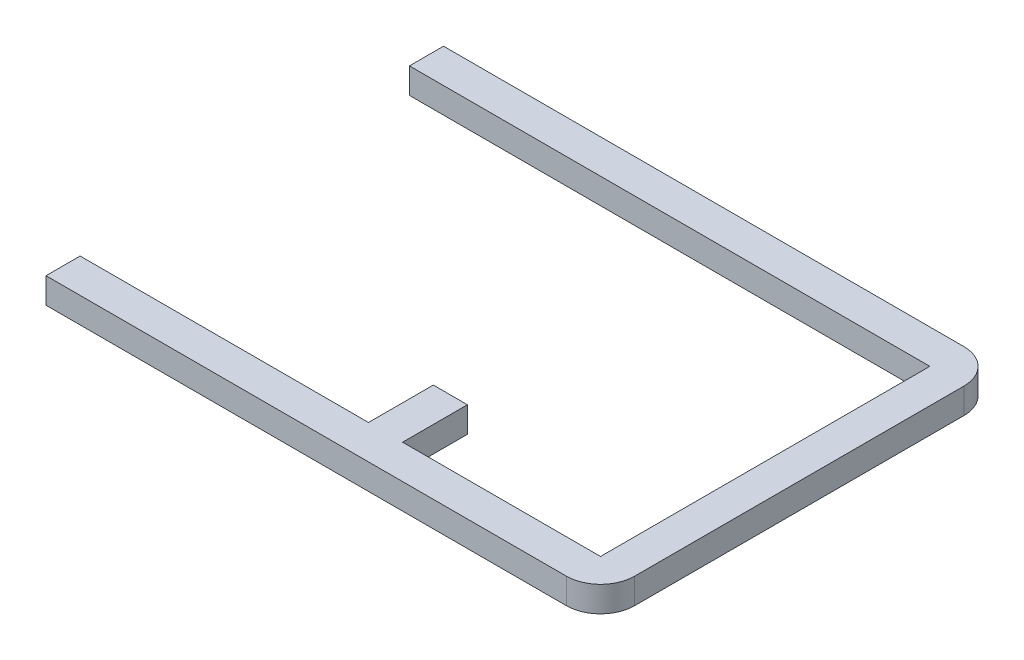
ISO-10303-21;
HEADER;
FILE_DESCRIPTION(('STEP AP214'),'2;1');
FILE_NAME('part.step','',(''),(''),'','','');
FILE_SCHEMA(('AUTOMOTIVE_DESIGN { 1 0 10303 214 1 1 1 1 }'));
ENDSEC;
DATA;
#1=APPLICATION_CONTEXT('core data for automotive mechanical design processes');
#2=APPLICATION_PROTOCOL_DEFINITION('international standard','automotive_design',2000,#1);
#3=PRODUCT_CONTEXT('',#1,'mechanical');
#4=PRODUCT('Part','Part','',(#3));
#5=PRODUCT_RELATED_PRODUCT_CATEGORY('part','',(#4));
#6=PRODUCT_DEFINITION_FORMATION('','',#4);
#7=PRODUCT_DEFINITION_CONTEXT('part definition',#1,'design');
#8=PRODUCT_DEFINITION('design','',#6,#7);
#9=PRODUCT_DEFINITION_SHAPE('','',#8);
#10=(LENGTH_UNIT() NAMED_UNIT(*) SI_UNIT(.MILLI.,.METRE.));
#11=(NAMED_UNIT(*) PLANE_ANGLE_UNIT() SI_UNIT($,.RADIAN.));
#12=(NAMED_UNIT(*) SI_UNIT($,.STERADIAN.) SOLID_ANGLE_UNIT());
#13=UNCERTAINTY_MEASURE_WITH_UNIT(LENGTH_MEASURE(1.E-05),#10,'distance_accuracy_value','');
#14=(GEOMETRIC_REPRESENTATION_CONTEXT(3) GLOBAL_UNCERTAINTY_ASSIGNED_CONTEXT((#13)) GLOBAL_UNIT_ASSIGNED_CONTEXT((#10,
#11,#12)) REPRESENTATION_CONTEXT('',''));
#15=CARTESIAN_POINT('',(0.,0.,0.));
#16=DIRECTION('',(0.,0.,1.));
#17=DIRECTION('',(1.,0.,0.));
#18=AXIS2_PLACEMENT_3D('',#15,#16,#17);
#19=CARTESIAN_POINT('',(0.,7.5,-10.));
#20=DIRECTION('',(0.,0.,-1.));
#21=DIRECTION('',(1.,0.,0.));
#22=AXIS2_PLACEMENT_3D('',#19,#20,#21);
#23=PLANE('',#22);
#24=DIRECTION('',(0.,1.,0.));
#25=VECTOR('',#24,1.);
#26=CARTESIAN_POINT('',(-78.,-21.4709105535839,-10.));
#27=LINE('',#26,#25);
#28=CARTESIAN_POINT('',(-78.,0.,-10.));
#29=VERTEX_POINT('',#28);
#30=CARTESIAN_POINT('',(-78.,7.5,-10.));
#31=VERTEX_POINT('',#30);
#32=EDGE_CURVE('E222',#29,#31,#27,.T.);
#33=ORIENTED_EDGE('',*,*,#32,.F.);
#34=DIRECTION('',(-1.,0.,0.));
#35=VECTOR('',#34,1.);
#36=CARTESIAN_POINT('',(0.,0.,-10.));
#37=LINE('',#36,#35);
#38=CARTESIAN_POINT('',(-162.5,0.,-10.));
#39=VERTEX_POINT('',#38);
#40=EDGE_CURVE('E220',#29,#39,#37,.T.);
#41=ORIENTED_EDGE('',*,*,#40,.T.);
#42=DIRECTION('',(0.,-1.,0.));
#43=VECTOR('',#42,1.);
#44=CARTESIAN_POINT('',(-162.5,7.5,-10.));
#45=LINE('',#44,#43);
#46=CARTESIAN_POINT('',(-162.5,7.5,-10.));
#47=VERTEX_POINT('',#46);
#48=EDGE_CURVE('E384',#47,#39,#45,.T.);
#49=ORIENTED_EDGE('',*,*,#48,.F.);
#50=DIRECTION('',(-1.,0.,0.));
#51=VECTOR('',#50,1.);
#52=CARTESIAN_POINT('',(0.,7.5,-10.));
#53=LINE('',#52,#51);
#54=EDGE_CURVE('E52',#31,#47,#53,.T.);
#55=ORIENTED_EDGE('',*,*,#54,.F.);
#56=EDGE_LOOP('',(#33,#41,#49,#55));
#57=FACE_BOUND('',#56,.T.);
#58=ADVANCED_FACE('F37',(#57),#23,.T.);
#59=CARTESIAN_POINT('',(0.,7.5,0.));
#60=DIRECTION('',(0.,0.,-1.));
#61=DIRECTION('',(1.,0.,0.));
#62=AXIS2_PLACEMENT_3D('',#59,#60,#61);
#63=PLANE('',#62);
#64=DIRECTION('',(-1.,0.,0.));
#65=VECTOR('',#64,1.);
#66=CARTESIAN_POINT('',(0.,7.5,0.));
#67=LINE('',#66,#65);
#68=CARTESIAN_POINT('',(-10.,7.5,0.));
#69=VERTEX_POINT('',#68);
#70=CARTESIAN_POINT('',(-162.5,7.5,0.));
#71=VERTEX_POINT('',#70);
#72=EDGE_CURVE('E336',#69,#71,#67,.T.);
#73=ORIENTED_EDGE('',*,*,#72,.T.);
#74=DIRECTION('',(0.,-1.,0.));
#75=VECTOR('',#74,1.);
#76=CARTESIAN_POINT('',(-162.5,7.5,0.));
#77=LINE('',#76,#75);
#78=CARTESIAN_POINT('',(-162.5,0.,0.));
#79=VERTEX_POINT('',#78);
#80=EDGE_CURVE('E387',#71,#79,#77,.T.);
#81=ORIENTED_EDGE('',*,*,#80,.T.);
#82=DIRECTION('',(-1.,0.,0.));
#83=VECTOR('',#82,1.);
#84=CARTESIAN_POINT('',(0.,0.,0.));
#85=LINE('',#84,#83);
#86=CARTESIAN_POINT('',(-10.,0.,0.));
#87=VERTEX_POINT('',#86);
#88=EDGE_CURVE('E265',#87,#79,#85,.T.);
#89=ORIENTED_EDGE('',*,*,#88,.F.);
#90=DIRECTION('',(0.,-1.,0.));
#91=VECTOR('',#90,1.);
#92=CARTESIAN_POINT('',(-10.,7.5,0.));
#93=LINE('',#92,#91);
#94=EDGE_CURVE('E11',#69,#87,#93,.T.);
#95=ORIENTED_EDGE('',*,*,#94,.F.);
#96=EDGE_LOOP('',(#73,#81,#89,#95));
#97=FACE_BOUND('',#96,.T.);
#98=ADVANCED_FACE('F446',(#97),#63,.F.);
#99=CARTESIAN_POINT('',(-162.5,7.5,-10.));
#100=DIRECTION('',(-1.,0.,0.));
#101=DIRECTION('',(0.,0.,-1.));
#102=AXIS2_PLACEMENT_3D('',#99,#100,#101);
#103=PLANE('',#102);
#104=DIRECTION('',(0.,0.,1.));
#105=VECTOR('',#104,1.);
#106=CARTESIAN_POINT('',(-162.5,0.,-10.));
#107=LINE('',#106,#105);
#108=EDGE_CURVE('E359',#39,#79,#107,.T.);
#109=ORIENTED_EDGE('',*,*,#108,.T.);
#110=ORIENTED_EDGE('',*,*,#80,.F.);
#111=DIRECTION('',(0.,0.,1.));
#112=VECTOR('',#111,1.);
#113=CARTESIAN_POINT('',(-162.5,7.5,-10.));
#114=LINE('',#113,#112);
#115=EDGE_CURVE('E339',#47,#71,#114,.T.);
#116=ORIENTED_EDGE('',*,*,#115,.F.);
#117=ORIENTED_EDGE('',*,*,#48,.T.);
#118=EDGE_LOOP('',(#109,#110,#116,#117));
#119=FACE_BOUND('',#118,.T.);
#120=ADVANCED_FACE('F444',(#119),#103,.T.);
#121=DIRECTION('',(0.,1.,0.));
#122=VECTOR('',#121,1.);
#123=CARTESIAN_POINT('',(-68.,-21.4709105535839,-10.));
#124=LINE('',#123,#122);
#125=CARTESIAN_POINT('',(-68.,0.,-10.));
#126=VERTEX_POINT('',#125);
#127=CARTESIAN_POINT('',(-68.,7.5,-10.));
#128=VERTEX_POINT('',#127);
#129=EDGE_CURVE('E60',#126,#128,#124,.T.);
#130=ORIENTED_EDGE('',*,*,#129,.T.);
#131=CARTESIAN_POINT('',(-10.,7.5,-10.));
#132=VERTEX_POINT('',#131);
#133=EDGE_CURVE('E342',#132,#128,#53,.T.);
#134=ORIENTED_EDGE('',*,*,#133,.F.);
#135=DIRECTION('',(0.,-1.,0.));
#136=VECTOR('',#135,1.);
#137=CARTESIAN_POINT('',(-10.,7.5,-10.));
#138=LINE('',#137,#136);
#139=CARTESIAN_POINT('',(-10.,0.,-10.));
#140=VERTEX_POINT('',#139);
#141=EDGE_CURVE('E381',#132,#140,#138,.T.);
#142=ORIENTED_EDGE('',*,*,#141,.T.);
#143=EDGE_CURVE('E361',#140,#126,#37,.T.);
#144=ORIENTED_EDGE('',*,*,#143,.T.);
#145=EDGE_LOOP('',(#130,#134,#142,#144));
#146=FACE_BOUND('',#145,.T.);
#147=ADVANCED_FACE('F453',(#146),#23,.T.);
#148=CARTESIAN_POINT('',(-10.,7.5,0.));
#149=DIRECTION('',(-1.,0.,0.));
#150=DIRECTION('',(0.,0.,-1.));
#151=AXIS2_PLACEMENT_3D('',#148,#149,#150);
#152=PLANE('',#151);
#153=DIRECTION('',(0.,0.,-1.));
#154=VECTOR('',#153,1.);
#155=CARTESIAN_POINT('',(-10.,0.,0.));
#156=LINE('',#155,#154);
#157=CARTESIAN_POINT('',(-10.,0.,-106.5));
#158=VERTEX_POINT('',#157);
#159=EDGE_CURVE('E363',#158,#140,#156,.F.);
#160=ORIENTED_EDGE('',*,*,#159,.T.);
#161=ORIENTED_EDGE('',*,*,#141,.F.);
#162=DIRECTION('',(0.,0.,-1.));
#163=VECTOR('',#162,1.);
#164=CARTESIAN_POINT('',(-10.,7.5,0.));
#165=LINE('',#164,#163);
#166=CARTESIAN_POINT('',(-10.,7.5,-106.5));
#167=VERTEX_POINT('',#166);
#168=EDGE_CURVE('E344',#167,#132,#165,.F.);
#169=ORIENTED_EDGE('',*,*,#168,.F.);
#170=DIRECTION('',(0.,-1.,0.));
#171=VECTOR('',#170,1.);
#172=CARTESIAN_POINT('',(-10.,7.5,-106.5));
#173=LINE('',#172,#171);
#174=EDGE_CURVE('E378',#167,#158,#173,.T.);
#175=ORIENTED_EDGE('',*,*,#174,.T.);
#176=EDGE_LOOP('',(#160,#161,#169,#175));
#177=FACE_BOUND('',#176,.T.);
#178=ADVANCED_FACE('F436',(#177),#152,.T.);
#179=CARTESIAN_POINT('',(0.,7.5,-106.5));
#180=DIRECTION('',(0.,0.,1.));
#181=DIRECTION('',(-1.,0.,0.));
#182=AXIS2_PLACEMENT_3D('',#179,#180,#181);
#183=PLANE('',#182);
#184=DIRECTION('',(-1.,0.,0.));
#185=VECTOR('',#184,1.);
#186=CARTESIAN_POINT('',(0.,0.,-106.5));
#187=LINE('',#186,#185);
#188=CARTESIAN_POINT('',(-162.5,0.,-106.5));
#189=VERTEX_POINT('',#188);
#190=EDGE_CURVE('E365',#189,#158,#187,.F.);
#191=ORIENTED_EDGE('',*,*,#190,.T.);
#192=ORIENTED_EDGE('',*,*,#174,.F.);
#193=DIRECTION('',(-1.,0.,0.));
#194=VECTOR('',#193,1.);
#195=CARTESIAN_POINT('',(0.,7.5,-106.5));
#196=LINE('',#195,#194);
#197=CARTESIAN_POINT('',(-162.5,7.5,-106.5));
#198=VERTEX_POINT('',#197);
#199=EDGE_CURVE('E346',#198,#167,#196,.F.);
#200=ORIENTED_EDGE('',*,*,#199,.F.);
#201=DIRECTION('',(0.,-1.,0.));
#202=VECTOR('',#201,1.);
#203=CARTESIAN_POINT('',(-162.5,7.5,-106.5));
#204=LINE('',#203,#202);
#205=EDGE_CURVE('E375',#198,#189,#204,.T.);
#206=ORIENTED_EDGE('',*,*,#205,.T.);
#207=EDGE_LOOP('',(#191,#192,#200,#206));
#208=FACE_BOUND('',#207,.T.);
#209=ADVANCED_FACE('F431',(#208),#183,.T.);
#210=CARTESIAN_POINT('',(-162.5,7.5,-116.5));
#211=DIRECTION('',(-1.,0.,0.));
#212=DIRECTION('',(0.,0.,-1.));
#213=AXIS2_PLACEMENT_3D('',#210,#211,#212);
#214=PLANE('',#213);
#215=DIRECTION('',(0.,0.,1.));
#216=VECTOR('',#215,1.);
#217=CARTESIAN_POINT('',(-162.5,0.,-116.5));
#218=LINE('',#217,#216);
#219=CARTESIAN_POINT('',(-162.5,0.,-116.5));
#220=VERTEX_POINT('',#219);
#221=EDGE_CURVE('E367',#220,#189,#218,.T.);
#222=ORIENTED_EDGE('',*,*,#221,.T.);
#223=ORIENTED_EDGE('',*,*,#205,.F.);
#224=DIRECTION('',(0.,0.,1.));
#225=VECTOR('',#224,1.);
#226=CARTESIAN_POINT('',(-162.5,7.5,-116.5));
#227=LINE('',#226,#225);
#228=CARTESIAN_POINT('',(-162.5,7.5,-116.5));
#229=VERTEX_POINT('',#228);
#230=EDGE_CURVE('E348',#229,#198,#227,.T.);
#231=ORIENTED_EDGE('',*,*,#230,.F.);
#232=DIRECTION('',(0.,-1.,0.));
#233=VECTOR('',#232,1.);
#234=CARTESIAN_POINT('',(-162.5,7.5,-116.5));
#235=LINE('',#234,#233);
#236=EDGE_CURVE('E356',#229,#220,#235,.T.);
#237=ORIENTED_EDGE('',*,*,#236,.T.);
#238=EDGE_LOOP('',(#222,#223,#231,#237));
#239=FACE_BOUND('',#238,.T.);
#240=ADVANCED_FACE('F428',(#239),#214,.T.);
#241=CARTESIAN_POINT('',(0.,7.5,-116.5));
#242=DIRECTION('',(0.,0.,1.));
#243=DIRECTION('',(-1.,0.,0.));
#244=AXIS2_PLACEMENT_3D('',#241,#242,#243);
#245=PLANE('',#244);
#246=DIRECTION('',(1.,0.,0.));
#247=VECTOR('',#246,1.);
#248=CARTESIAN_POINT('',(0.,0.,-116.5));
#249=LINE('',#248,#247);
#250=CARTESIAN_POINT('',(-10.,0.,-116.5));
#251=VERTEX_POINT('',#250);
#252=EDGE_CURVE('E369',#220,#251,#249,.T.);
#253=ORIENTED_EDGE('',*,*,#252,.F.);
#254=ORIENTED_EDGE('',*,*,#236,.F.);
#255=DIRECTION('',(1.,0.,0.));
#256=VECTOR('',#255,1.);
#257=CARTESIAN_POINT('',(0.,7.5,-116.5));
#258=LINE('',#257,#256);
#259=CARTESIAN_POINT('',(-10.,7.5,-116.5));
#260=VERTEX_POINT('',#259);
#261=EDGE_CURVE('E350',#229,#260,#258,.T.);
#262=ORIENTED_EDGE('',*,*,#261,.T.);
#263=DIRECTION('',(0.,-1.,0.));
#264=VECTOR('',#263,1.);
#265=CARTESIAN_POINT('',(-10.,7.5,-116.5));
#266=LINE('',#265,#264);
#267=EDGE_CURVE('E400',#251,#260,#266,.F.);
#268=ORIENTED_EDGE('',*,*,#267,.F.);
#269=EDGE_LOOP('',(#253,#254,#262,#268));
#270=FACE_BOUND('',#269,.T.);
#271=ADVANCED_FACE('F421',(#270),#245,.F.);
#272=CARTESIAN_POINT('',(0.,7.5,0.));
#273=DIRECTION('',(-1.,0.,0.));
#274=DIRECTION('',(0.,0.,-1.));
#275=AXIS2_PLACEMENT_3D('',#272,#273,#274);
#276=PLANE('',#275);
#277=DIRECTION('',(0.,0.,1.));
#278=VECTOR('',#277,1.);
#279=CARTESIAN_POINT('',(0.,7.5,0.));
#280=LINE('',#279,#278);
#281=CARTESIAN_POINT('',(0.,7.5,-106.5));
#282=VERTEX_POINT('',#281);
#283=CARTESIAN_POINT('',(0.,7.5,-10.));
#284=VERTEX_POINT('',#283);
#285=EDGE_CURVE('E353',#282,#284,#280,.T.);
#286=ORIENTED_EDGE('',*,*,#285,.T.);
#287=DIRECTION('',(0.,-1.,0.));
#288=VECTOR('',#287,1.);
#289=CARTESIAN_POINT('',(0.,7.5,-10.));
#290=LINE('',#289,#288);
#291=CARTESIAN_POINT('',(0.,0.,-10.));
#292=VERTEX_POINT('',#291);
#293=EDGE_CURVE('E390',#292,#284,#290,.F.);
#294=ORIENTED_EDGE('',*,*,#293,.F.);
#295=DIRECTION('',(0.,0.,1.));
#296=VECTOR('',#295,1.);
#297=CARTESIAN_POINT('',(0.,0.,0.));
#298=LINE('',#297,#296);
#299=CARTESIAN_POINT('',(0.,0.,-106.5));
#300=VERTEX_POINT('',#299);
#301=EDGE_CURVE('E340',#300,#292,#298,.T.);
#302=ORIENTED_EDGE('',*,*,#301,.F.);
#303=DIRECTION('',(0.,-1.,0.));
#304=VECTOR('',#303,1.);
#305=CARTESIAN_POINT('',(0.,7.5,-106.5));
#306=LINE('',#305,#304);
#307=EDGE_CURVE('E393',#282,#300,#306,.T.);
#308=ORIENTED_EDGE('',*,*,#307,.F.);
#309=EDGE_LOOP('',(#286,#294,#302,#308));
#310=FACE_BOUND('',#309,.T.);
#311=ADVANCED_FACE('F412',(#310),#276,.F.);
#312=CARTESIAN_POINT('',(0.,7.5,0.));
#313=DIRECTION('',(0.,-1.,0.));
#314=DIRECTION('',(1.,0.,0.));
#315=AXIS2_PLACEMENT_3D('',#312,#313,#314);
#316=PLANE('',#315);
#317=ORIENTED_EDGE('',*,*,#261,.F.);
#318=ORIENTED_EDGE('',*,*,#230,.T.);
#319=ORIENTED_EDGE('',*,*,#199,.T.);
#320=ORIENTED_EDGE('',*,*,#168,.T.);
#321=ORIENTED_EDGE('',*,*,#133,.T.);
#322=DIRECTION('',(0.,0.,-1.));
#323=VECTOR('',#322,1.);
#324=CARTESIAN_POINT('',(-68.,7.5,-10.));
#325=LINE('',#324,#323);
#326=CARTESIAN_POINT('',(-68.,7.5,-29.));
#327=VERTEX_POINT('',#326);
#328=EDGE_CURVE('E241',#128,#327,#325,.T.);
#329=ORIENTED_EDGE('',*,*,#328,.T.);
#330=DIRECTION('',(-1.,0.,0.));
#331=VECTOR('',#330,1.);
#332=CARTESIAN_POINT('',(-68.,7.5,-29.));
#333=LINE('',#332,#331);
#334=CARTESIAN_POINT('',(-78.,7.5,-29.));
#335=VERTEX_POINT('',#334);
#336=EDGE_CURVE('E237',#327,#335,#333,.T.);
#337=ORIENTED_EDGE('',*,*,#336,.T.);
#338=DIRECTION('',(0.,0.,1.));
#339=VECTOR('',#338,1.);
#340=CARTESIAN_POINT('',(-78.,7.5,-10.));
#341=LINE('',#340,#339);
#342=EDGE_CURVE('E228',#335,#31,#341,.T.);
#343=ORIENTED_EDGE('',*,*,#342,.T.);
#344=ORIENTED_EDGE('',*,*,#54,.T.);
#345=ORIENTED_EDGE('',*,*,#115,.T.);
#346=ORIENTED_EDGE('',*,*,#72,.F.);
#347=CARTESIAN_POINT('',(-10.,7.5,-10.));
#348=DIRECTION('',(0.,1.,0.));
#349=DIRECTION('',(0.,0.,-1.));
#350=AXIS2_PLACEMENT_3D('',#347,#348,#349);
#351=CIRCLE('',#350,10.);
#352=EDGE_CURVE('E403',#284,#69,#351,.F.);
#353=ORIENTED_EDGE('',*,*,#352,.F.);
#354=ORIENTED_EDGE('',*,*,#285,.F.);
#355=CARTESIAN_POINT('',(-10.,7.5,-106.5));
#356=DIRECTION('',(0.,1.,0.));
#357=DIRECTION('',(0.,0.,-1.));
#358=AXIS2_PLACEMENT_3D('',#355,#356,#357);
#359=CIRCLE('',#358,10.);
#360=EDGE_CURVE('E45',#260,#282,#359,.F.);
#361=ORIENTED_EDGE('',*,*,#360,.F.);
#362=EDGE_LOOP('',(#317,#318,#319,#320,#321,#329,#337,#343,#344,#345,#346,#353,#354,#361));
#363=FACE_BOUND('',#362,.T.);
#364=ADVANCED_FACE('F414',(#363),#316,.F.);
#365=CARTESIAN_POINT('',(0.,0.,0.));
#366=DIRECTION('',(0.,-1.,0.));
#367=DIRECTION('',(1.,0.,0.));
#368=AXIS2_PLACEMENT_3D('',#365,#366,#367);
#369=PLANE('',#368);
#370=DIRECTION('',(0.,0.,-1.));
#371=VECTOR('',#370,1.);
#372=CARTESIAN_POINT('',(-72.5,0.,-2.5));
#373=LINE('',#372,#371);
#374=CARTESIAN_POINT('',(-72.5,0.,-2.5));
#375=VERTEX_POINT('',#374);
#376=CARTESIAN_POINT('',(-72.5,0.,-7.5));
#377=VERTEX_POINT('',#376);
#378=EDGE_CURVE('E249',#375,#377,#373,.T.);
#379=ORIENTED_EDGE('',*,*,#378,.T.);
#380=DIRECTION('',(-1.,0.,0.));
#381=VECTOR('',#380,1.);
#382=CARTESIAN_POINT('',(-72.5,0.,-7.5));
#383=LINE('',#382,#381);
#384=CARTESIAN_POINT('',(-122.5,0.,-7.5));
#385=VERTEX_POINT('',#384);
#386=EDGE_CURVE('E252',#377,#385,#383,.T.);
#387=ORIENTED_EDGE('',*,*,#386,.T.);
#388=DIRECTION('',(0.,0.,1.));
#389=VECTOR('',#388,1.);
#390=CARTESIAN_POINT('',(-122.5,0.,-2.5));
#391=LINE('',#390,#389);
#392=CARTESIAN_POINT('',(-122.5,0.,-2.5));
#393=VERTEX_POINT('',#392);
#394=EDGE_CURVE('E256',#385,#393,#391,.T.);
#395=ORIENTED_EDGE('',*,*,#394,.T.);
#396=DIRECTION('',(1.,0.,0.));
#397=VECTOR('',#396,1.);
#398=CARTESIAN_POINT('',(-72.5,0.,-2.5));
#399=LINE('',#398,#397);
#400=EDGE_CURVE('E259',#393,#375,#399,.T.);
#401=ORIENTED_EDGE('',*,*,#400,.T.);
#402=EDGE_LOOP('',(#379,#387,#395,#401));
#403=FACE_BOUND('',#402,.T.);
#404=DIRECTION('',(0.,0.,-1.));
#405=VECTOR('',#404,1.);
#406=CARTESIAN_POINT('',(-2.49999999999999,0.,-33.25));
#407=LINE('',#406,#405);
#408=CARTESIAN_POINT('',(-2.49999999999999,0.,-33.25));
#409=VERTEX_POINT('',#408);
#410=CARTESIAN_POINT('',(-2.49999999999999,0.,-83.25));
#411=VERTEX_POINT('',#410);
#412=EDGE_CURVE('E253',#409,#411,#407,.T.);
#413=ORIENTED_EDGE('',*,*,#412,.T.);
#414=DIRECTION('',(-1.,0.,0.));
#415=VECTOR('',#414,1.);
#416=CARTESIAN_POINT('',(-2.49999999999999,0.,-83.25));
#417=LINE('',#416,#415);
#418=CARTESIAN_POINT('',(-7.49999999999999,0.,-83.25));
#419=VERTEX_POINT('',#418);
#420=EDGE_CURVE('E304',#411,#419,#417,.T.);
#421=ORIENTED_EDGE('',*,*,#420,.T.);
#422=DIRECTION('',(0.,0.,1.));
#423=VECTOR('',#422,1.);
#424=CARTESIAN_POINT('',(-7.49999999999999,0.,-33.25));
#425=LINE('',#424,#423);
#426=CARTESIAN_POINT('',(-7.49999999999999,0.,-33.25));
#427=VERTEX_POINT('',#426);
#428=EDGE_CURVE('E301',#419,#427,#425,.T.);
#429=ORIENTED_EDGE('',*,*,#428,.T.);
#430=DIRECTION('',(1.,0.,0.));
#431=VECTOR('',#430,1.);
#432=CARTESIAN_POINT('',(-2.49999999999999,0.,-33.25));
#433=LINE('',#432,#431);
#434=EDGE_CURVE('E290',#427,#409,#433,.T.);
#435=ORIENTED_EDGE('',*,*,#434,.T.);
#436=EDGE_LOOP('',(#413,#421,#429,#435));
#437=FACE_BOUND('',#436,.T.);
#438=DIRECTION('',(0.,0.,-1.));
#439=VECTOR('',#438,1.);
#440=CARTESIAN_POINT('',(-72.5,0.,-109.));
#441=LINE('',#440,#439);
#442=CARTESIAN_POINT('',(-72.5,0.,-109.));
#443=VERTEX_POINT('',#442);
#444=CARTESIAN_POINT('',(-72.5,0.,-114.));
#445=VERTEX_POINT('',#444);
#446=EDGE_CURVE('E298',#443,#445,#441,.T.);
#447=ORIENTED_EDGE('',*,*,#446,.T.);
#448=DIRECTION('',(-1.,0.,0.));
#449=VECTOR('',#448,1.);
#450=CARTESIAN_POINT('',(-72.5,0.,-114.));
#451=LINE('',#450,#449);
#452=CARTESIAN_POINT('',(-122.5,0.,-114.));
#453=VERTEX_POINT('',#452);
#454=EDGE_CURVE('E331',#445,#453,#451,.T.);
#455=ORIENTED_EDGE('',*,*,#454,.T.);
#456=DIRECTION('',(0.,0.,1.));
#457=VECTOR('',#456,1.);
#458=CARTESIAN_POINT('',(-122.5,0.,-109.));
#459=LINE('',#458,#457);
#460=CARTESIAN_POINT('',(-122.5,0.,-109.));
#461=VERTEX_POINT('',#460);
#462=EDGE_CURVE('E328',#453,#461,#459,.T.);
#463=ORIENTED_EDGE('',*,*,#462,.T.);
#464=DIRECTION('',(1.,0.,0.));
#465=VECTOR('',#464,1.);
#466=CARTESIAN_POINT('',(-72.5,0.,-109.));
#467=LINE('',#466,#465);
#468=EDGE_CURVE('E319',#461,#443,#467,.T.);
#469=ORIENTED_EDGE('',*,*,#468,.T.);
#470=EDGE_LOOP('',(#447,#455,#463,#469));
#471=FACE_BOUND('',#470,.T.);
#472=ORIENTED_EDGE('',*,*,#301,.T.);
#473=CARTESIAN_POINT('',(-10.,0.,-10.));
#474=DIRECTION('',(0.,1.,0.));
#475=DIRECTION('',(0.,0.,-1.));
#476=AXIS2_PLACEMENT_3D('',#473,#474,#475);
#477=CIRCLE('',#476,10.);
#478=EDGE_CURVE('E396',#87,#292,#477,.T.);
#479=ORIENTED_EDGE('',*,*,#478,.F.);
#480=ORIENTED_EDGE('',*,*,#88,.T.);
#481=ORIENTED_EDGE('',*,*,#108,.F.);
#482=ORIENTED_EDGE('',*,*,#40,.F.);
#483=DIRECTION('',(0.,0.,1.));
#484=VECTOR('',#483,1.);
#485=CARTESIAN_POINT('',(-78.,0.,-10.));
#486=LINE('',#485,#484);
#487=CARTESIAN_POINT('',(-78.,0.,-29.));
#488=VERTEX_POINT('',#487);
#489=EDGE_CURVE('E211',#488,#29,#486,.T.);
#490=ORIENTED_EDGE('',*,*,#489,.F.);
#491=DIRECTION('',(-1.,0.,0.));
#492=VECTOR('',#491,1.);
#493=CARTESIAN_POINT('',(-68.,0.,-29.));
#494=LINE('',#493,#492);
#495=CARTESIAN_POINT('',(-68.,0.,-29.));
#496=VERTEX_POINT('',#495);
#497=EDGE_CURVE('E217',#496,#488,#494,.T.);
#498=ORIENTED_EDGE('',*,*,#497,.F.);
#499=DIRECTION('',(0.,0.,-1.));
#500=VECTOR('',#499,1.);
#501=CARTESIAN_POINT('',(-68.,0.,-10.));
#502=LINE('',#501,#500);
#503=EDGE_CURVE('E243',#126,#496,#502,.T.);
#504=ORIENTED_EDGE('',*,*,#503,.F.);
#505=ORIENTED_EDGE('',*,*,#143,.F.);
#506=ORIENTED_EDGE('',*,*,#159,.F.);
#507=ORIENTED_EDGE('',*,*,#190,.F.);
#508=ORIENTED_EDGE('',*,*,#221,.F.);
#509=ORIENTED_EDGE('',*,*,#252,.T.);
#510=CARTESIAN_POINT('',(-10.,0.,-106.5));
#511=DIRECTION('',(0.,1.,0.));
#512=DIRECTION('',(0.,0.,-1.));
#513=AXIS2_PLACEMENT_3D('',#510,#511,#512);
#514=CIRCLE('',#513,10.);
#515=EDGE_CURVE('E398',#300,#251,#514,.T.);
#516=ORIENTED_EDGE('',*,*,#515,.F.);
#517=EDGE_LOOP('',(#472,#479,#480,#481,#482,#490,#498,#504,#505,#506,#507,#508,#509,#516));
#518=FACE_BOUND('',#517,.T.);
#519=ADVANCED_FACE('F214',(#403,#437,#471,#518),#369,.T.);
#520=CARTESIAN_POINT('',(-10.,7.5,-106.5));
#521=DIRECTION('',(0.,-1.,0.));
#522=DIRECTION('',(0.,0.,-1.));
#523=AXIS2_PLACEMENT_3D('',#520,#521,#522);
#524=CYLINDRICAL_SURFACE('',#523,10.);
#525=ORIENTED_EDGE('',*,*,#360,.T.);
#526=ORIENTED_EDGE('',*,*,#307,.T.);
#527=ORIENTED_EDGE('',*,*,#515,.T.);
#528=ORIENTED_EDGE('',*,*,#267,.T.);
#529=EDGE_LOOP('',(#525,#526,#527,#528));
#530=FACE_BOUND('',#529,.T.);
#531=ADVANCED_FACE('F406',(#530),#524,.T.);
#532=CARTESIAN_POINT('',(-10.,7.5,-10.));
#533=DIRECTION('',(0.,-1.,0.));
#534=DIRECTION('',(0.,0.,-1.));
#535=AXIS2_PLACEMENT_3D('',#532,#533,#534);
#536=CYLINDRICAL_SURFACE('',#535,10.);
#537=ORIENTED_EDGE('',*,*,#352,.T.);
#538=ORIENTED_EDGE('',*,*,#94,.T.);
#539=ORIENTED_EDGE('',*,*,#478,.T.);
#540=ORIENTED_EDGE('',*,*,#293,.T.);
#541=EDGE_LOOP('',(#537,#538,#539,#540));
#542=FACE_BOUND('',#541,.T.);
#543=ADVANCED_FACE('F39',(#542),#536,.T.);
#544=CARTESIAN_POINT('',(-72.5,0.,-109.));
#545=DIRECTION('',(0.707106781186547,0.707106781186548,0.));
#546=DIRECTION('',(0.707106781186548,-0.707106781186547,0.));
#547=AXIS2_PLACEMENT_3D('',#544,#545,#546);
#548=PLANE('',#547);
#549=ORIENTED_EDGE('',*,*,#446,.F.);
#550=DIRECTION('',(0.577350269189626,-0.577350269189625,0.577350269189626));
#551=VECTOR('',#550,1.);
#552=CARTESIAN_POINT('',(-72.5,0.,-109.));
#553=LINE('',#552,#551);
#554=CARTESIAN_POINT('',(-74.6,2.1,-111.1));
#555=VERTEX_POINT('',#554);
#556=EDGE_CURVE('E248',#555,#443,#553,.T.);
#557=ORIENTED_EDGE('',*,*,#556,.F.);
#558=DIRECTION('',(0.,0.,-1.));
#559=VECTOR('',#558,1.);
#560=CARTESIAN_POINT('',(-74.6,2.1,0.));
#561=LINE('',#560,#559);
#562=CARTESIAN_POINT('',(-74.6,2.1,-111.9));
#563=VERTEX_POINT('',#562);
#564=EDGE_CURVE('E311',#555,#563,#561,.T.);
#565=ORIENTED_EDGE('',*,*,#564,.T.);
#566=DIRECTION('',(0.577350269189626,-0.577350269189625,-0.577350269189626));
#567=VECTOR('',#566,1.);
#568=CARTESIAN_POINT('',(-74.1666666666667,1.66666666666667,-112.333333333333));
#569=LINE('',#568,#567);
#570=EDGE_CURVE('E316',#563,#445,#569,.T.);
#571=ORIENTED_EDGE('',*,*,#570,.T.);
#572=EDGE_LOOP('',(#549,#557,#565,#571));
#573=FACE_BOUND('',#572,.T.);
#574=ADVANCED_FACE('F461',(#573),#548,.F.);
#575=CARTESIAN_POINT('',(-72.5,0.,-109.));
#576=DIRECTION('',(0.,0.707106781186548,0.707106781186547));
#577=DIRECTION('',(0.,-0.707106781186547,0.707106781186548));
#578=AXIS2_PLACEMENT_3D('',#575,#576,#577);
#579=PLANE('',#578);
#580=ORIENTED_EDGE('',*,*,#468,.F.);
#581=DIRECTION('',(-0.577350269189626,-0.577350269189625,0.577350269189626));
#582=VECTOR('',#581,1.);
#583=CARTESIAN_POINT('',(-122.5,0.,-109.));
#584=LINE('',#583,#582);
#585=CARTESIAN_POINT('',(-120.4,2.1,-111.1));
#586=VERTEX_POINT('',#585);
#587=EDGE_CURVE('E320',#586,#461,#584,.T.);
#588=ORIENTED_EDGE('',*,*,#587,.F.);
#589=DIRECTION('',(1.,0.,0.));
#590=VECTOR('',#589,1.);
#591=CARTESIAN_POINT('',(0.,2.1,-111.1));
#592=LINE('',#591,#590);
#593=EDGE_CURVE('E314',#586,#555,#592,.T.);
#594=ORIENTED_EDGE('',*,*,#593,.T.);
#595=ORIENTED_EDGE('',*,*,#556,.T.);
#596=EDGE_LOOP('',(#580,#588,#594,#595));
#597=FACE_BOUND('',#596,.T.);
#598=ADVANCED_FACE('F702',(#597),#579,.F.);
#599=CARTESIAN_POINT('',(-122.5,0.,-109.));
#600=DIRECTION('',(-0.707106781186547,0.707106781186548,0.));
#601=DIRECTION('',(0.707106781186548,0.707106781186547,0.));
#602=AXIS2_PLACEMENT_3D('',#599,#600,#601);
#603=PLANE('',#602);
#604=ORIENTED_EDGE('',*,*,#462,.F.);
#605=DIRECTION('',(-0.577350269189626,-0.577350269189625,-0.577350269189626));
#606=VECTOR('',#605,1.);
#607=CARTESIAN_POINT('',(-105.833333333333,16.6666666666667,-97.3333333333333));
#608=LINE('',#607,#606);
#609=CARTESIAN_POINT('',(-120.4,2.1,-111.9));
#610=VERTEX_POINT('',#609);
#611=EDGE_CURVE('E322',#610,#453,#608,.T.);
#612=ORIENTED_EDGE('',*,*,#611,.F.);
#613=DIRECTION('',(0.,0.,1.));
#614=VECTOR('',#613,1.);
#615=CARTESIAN_POINT('',(-120.4,2.1,0.));
#616=LINE('',#615,#614);
#617=EDGE_CURVE('E312',#610,#586,#616,.T.);
#618=ORIENTED_EDGE('',*,*,#617,.T.);
#619=ORIENTED_EDGE('',*,*,#587,.T.);
#620=EDGE_LOOP('',(#604,#612,#618,#619));
#621=FACE_BOUND('',#620,.T.);
#622=ADVANCED_FACE('F707',(#621),#603,.F.);
#623=CARTESIAN_POINT('',(-72.5,0.,-114.));
#624=DIRECTION('',(0.,0.707106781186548,-0.707106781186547));
#625=DIRECTION('',(0.,0.707106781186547,0.707106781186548));
#626=AXIS2_PLACEMENT_3D('',#623,#624,#625);
#627=PLANE('',#626);
#628=ORIENTED_EDGE('',*,*,#454,.F.);
#629=ORIENTED_EDGE('',*,*,#570,.F.);
#630=DIRECTION('',(-1.,0.,0.));
#631=VECTOR('',#630,1.);
#632=CARTESIAN_POINT('',(0.,2.1,-111.9));
#633=LINE('',#632,#631);
#634=EDGE_CURVE('E309',#563,#610,#633,.T.);
#635=ORIENTED_EDGE('',*,*,#634,.T.);
#636=ORIENTED_EDGE('',*,*,#611,.T.);
#637=EDGE_LOOP('',(#628,#629,#635,#636));
#638=FACE_BOUND('',#637,.T.);
#639=ADVANCED_FACE('F718',(#638),#627,.F.);
#640=CARTESIAN_POINT('',(0.,2.1,0.));
#641=DIRECTION('',(0.,-1.,0.));
#642=DIRECTION('',(0.,0.,-1.));
#643=AXIS2_PLACEMENT_3D('',#640,#641,#642);
#644=PLANE('',#643);
#645=ORIENTED_EDGE('',*,*,#564,.F.);
#646=ORIENTED_EDGE('',*,*,#593,.F.);
#647=ORIENTED_EDGE('',*,*,#617,.F.);
#648=ORIENTED_EDGE('',*,*,#634,.F.);
#649=EDGE_LOOP('',(#645,#646,#647,#648));
#650=FACE_BOUND('',#649,.T.);
#651=ADVANCED_FACE('F687',(#650),#644,.T.);
#652=CARTESIAN_POINT('',(-2.49999999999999,0.,-33.25));
#653=DIRECTION('',(0.707106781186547,0.707106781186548,0.));
#654=DIRECTION('',(0.707106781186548,-0.707106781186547,0.));
#655=AXIS2_PLACEMENT_3D('',#652,#653,#654);
#656=PLANE('',#655);
#657=ORIENTED_EDGE('',*,*,#412,.F.);
#658=DIRECTION('',(0.577350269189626,-0.577350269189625,0.577350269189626));
#659=VECTOR('',#658,1.);
#660=CARTESIAN_POINT('',(-2.49999999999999,0.,-33.25));
#661=LINE('',#660,#659);
#662=CARTESIAN_POINT('',(-4.59999999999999,2.1,-35.35));
#663=VERTEX_POINT('',#662);
#664=EDGE_CURVE('E294',#663,#409,#661,.T.);
#665=ORIENTED_EDGE('',*,*,#664,.F.);
#666=DIRECTION('',(0.,0.,-1.));
#667=VECTOR('',#666,1.);
#668=CARTESIAN_POINT('',(-4.59999999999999,2.1,0.));
#669=LINE('',#668,#667);
#670=CARTESIAN_POINT('',(-4.59999999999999,2.1,-81.15));
#671=VERTEX_POINT('',#670);
#672=EDGE_CURVE('E282',#663,#671,#669,.T.);
#673=ORIENTED_EDGE('',*,*,#672,.T.);
#674=DIRECTION('',(0.577350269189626,-0.577350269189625,-0.577350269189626));
#675=VECTOR('',#674,1.);
#676=CARTESIAN_POINT('',(-19.1666666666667,16.6666666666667,-66.5833333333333));
#677=LINE('',#676,#675);
#678=EDGE_CURVE('E287',#671,#411,#677,.T.);
#679=ORIENTED_EDGE('',*,*,#678,.T.);
#680=EDGE_LOOP('',(#657,#665,#673,#679));
#681=FACE_BOUND('',#680,.T.);
#682=ADVANCED_FACE('F658',(#681),#656,.F.);
#683=CARTESIAN_POINT('',(-2.49999999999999,0.,-33.25));
#684=DIRECTION('',(0.,0.707106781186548,0.707106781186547));
#685=DIRECTION('',(0.,-0.707106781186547,0.707106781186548));
#686=AXIS2_PLACEMENT_3D('',#683,#684,#685);
#687=PLANE('',#686);
#688=ORIENTED_EDGE('',*,*,#434,.F.);
#689=DIRECTION('',(-0.577350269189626,-0.577350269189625,0.577350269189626));
#690=VECTOR('',#689,1.);
#691=CARTESIAN_POINT('',(-7.49999999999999,0.,-33.25));
#692=LINE('',#691,#690);
#693=CARTESIAN_POINT('',(-5.39999999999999,2.1,-35.35));
#694=VERTEX_POINT('',#693);
#695=EDGE_CURVE('E291',#694,#427,#692,.T.);
#696=ORIENTED_EDGE('',*,*,#695,.F.);
#697=DIRECTION('',(1.,0.,0.));
#698=VECTOR('',#697,1.);
#699=CARTESIAN_POINT('',(0.,2.1,-35.35));
#700=LINE('',#699,#698);
#701=EDGE_CURVE('E285',#694,#663,#700,.T.);
#702=ORIENTED_EDGE('',*,*,#701,.T.);
#703=ORIENTED_EDGE('',*,*,#664,.T.);
#704=EDGE_LOOP('',(#688,#696,#702,#703));
#705=FACE_BOUND('',#704,.T.);
#706=ADVANCED_FACE('F652',(#705),#687,.F.);
#707=CARTESIAN_POINT('',(-7.49999999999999,0.,-33.25));
#708=DIRECTION('',(-0.707106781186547,0.707106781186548,0.));
#709=DIRECTION('',(0.707106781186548,0.707106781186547,0.));
#710=AXIS2_PLACEMENT_3D('',#707,#708,#709);
#711=PLANE('',#710);
#712=ORIENTED_EDGE('',*,*,#428,.F.);
#713=DIRECTION('',(-0.577350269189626,-0.577350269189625,-0.577350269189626));
#714=VECTOR('',#713,1.);
#715=CARTESIAN_POINT('',(-5.83333333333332,1.66666666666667,-81.5833333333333));
#716=LINE('',#715,#714);
#717=CARTESIAN_POINT('',(-5.39999999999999,2.1,-81.15));
#718=VERTEX_POINT('',#717);
#719=EDGE_CURVE('E293',#718,#419,#716,.T.);
#720=ORIENTED_EDGE('',*,*,#719,.F.);
#721=DIRECTION('',(0.,0.,1.));
#722=VECTOR('',#721,1.);
#723=CARTESIAN_POINT('',(-5.39999999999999,2.1,0.));
#724=LINE('',#723,#722);
#725=EDGE_CURVE('E283',#718,#694,#724,.T.);
#726=ORIENTED_EDGE('',*,*,#725,.T.);
#727=ORIENTED_EDGE('',*,*,#695,.T.);
#728=EDGE_LOOP('',(#712,#720,#726,#727));
#729=FACE_BOUND('',#728,.T.);
#730=ADVANCED_FACE('F657',(#729),#711,.F.);
#731=CARTESIAN_POINT('',(-2.49999999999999,0.,-83.25));
#732=DIRECTION('',(0.,0.707106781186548,-0.707106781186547));
#733=DIRECTION('',(0.,0.707106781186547,0.707106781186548));
#734=AXIS2_PLACEMENT_3D('',#731,#732,#733);
#735=PLANE('',#734);
#736=ORIENTED_EDGE('',*,*,#420,.F.);
#737=ORIENTED_EDGE('',*,*,#678,.F.);
#738=DIRECTION('',(-1.,0.,0.));
#739=VECTOR('',#738,1.);
#740=CARTESIAN_POINT('',(0.,2.1,-81.15));
#741=LINE('',#740,#739);
#742=EDGE_CURVE('E280',#671,#718,#741,.T.);
#743=ORIENTED_EDGE('',*,*,#742,.T.);
#744=ORIENTED_EDGE('',*,*,#719,.T.);
#745=EDGE_LOOP('',(#736,#737,#743,#744));
#746=FACE_BOUND('',#745,.T.);
#747=ADVANCED_FACE('F669',(#746),#735,.F.);
#748=CARTESIAN_POINT('',(0.,2.1,0.));
#749=DIRECTION('',(0.,-1.,0.));
#750=DIRECTION('',(0.,0.,-1.));
#751=AXIS2_PLACEMENT_3D('',#748,#749,#750);
#752=PLANE('',#751);
#753=ORIENTED_EDGE('',*,*,#672,.F.);
#754=ORIENTED_EDGE('',*,*,#701,.F.);
#755=ORIENTED_EDGE('',*,*,#725,.F.);
#756=ORIENTED_EDGE('',*,*,#742,.F.);
#757=EDGE_LOOP('',(#753,#754,#755,#756));
#758=FACE_BOUND('',#757,.T.);
#759=ADVANCED_FACE('F618',(#758),#752,.T.);
#760=CARTESIAN_POINT('',(-72.5,0.,-2.5));
#761=DIRECTION('',(0.707106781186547,0.707106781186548,0.));
#762=DIRECTION('',(0.707106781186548,-0.707106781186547,0.));
#763=AXIS2_PLACEMENT_3D('',#760,#761,#762);
#764=PLANE('',#763);
#765=ORIENTED_EDGE('',*,*,#378,.F.);
#766=DIRECTION('',(0.577350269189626,-0.577350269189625,0.577350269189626));
#767=VECTOR('',#766,1.);
#768=CARTESIAN_POINT('',(-72.5,0.,-2.5));
#769=LINE('',#768,#767);
#770=CARTESIAN_POINT('',(-74.6,2.1,-4.60000000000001));
#771=VERTEX_POINT('',#770);
#772=EDGE_CURVE('E263',#771,#375,#769,.T.);
#773=ORIENTED_EDGE('',*,*,#772,.F.);
#774=DIRECTION('',(0.,0.,-1.));
#775=VECTOR('',#774,1.);
#776=CARTESIAN_POINT('',(-74.6,2.1,0.));
#777=LINE('',#776,#775);
#778=CARTESIAN_POINT('',(-74.6,2.1,-5.4));
#779=VERTEX_POINT('',#778);
#780=EDGE_CURVE('E262',#771,#779,#777,.T.);
#781=ORIENTED_EDGE('',*,*,#780,.T.);
#782=DIRECTION('',(0.577350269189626,-0.577350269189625,-0.577350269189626));
#783=VECTOR('',#782,1.);
#784=CARTESIAN_POINT('',(-74.1666666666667,1.66666666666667,-5.83333333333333));
#785=LINE('',#784,#783);
#786=EDGE_CURVE('E267',#779,#377,#785,.T.);
#787=ORIENTED_EDGE('',*,*,#786,.T.);
#788=EDGE_LOOP('',(#765,#773,#781,#787));
#789=FACE_BOUND('',#788,.T.);
#790=ADVANCED_FACE('F612',(#789),#764,.F.);
#791=CARTESIAN_POINT('',(-72.5,0.,-2.5));
#792=DIRECTION('',(0.,0.707106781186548,0.707106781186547));
#793=DIRECTION('',(0.,-0.707106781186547,0.707106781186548));
#794=AXIS2_PLACEMENT_3D('',#791,#792,#793);
#795=PLANE('',#794);
#796=ORIENTED_EDGE('',*,*,#400,.F.);
#797=DIRECTION('',(-0.577350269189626,-0.577350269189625,0.577350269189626));
#798=VECTOR('',#797,1.);
#799=CARTESIAN_POINT('',(-122.5,0.,-2.5));
#800=LINE('',#799,#798);
#801=CARTESIAN_POINT('',(-120.4,2.1,-4.60000000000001));
#802=VERTEX_POINT('',#801);
#803=EDGE_CURVE('E266',#802,#393,#800,.T.);
#804=ORIENTED_EDGE('',*,*,#803,.F.);
#805=DIRECTION('',(1.,0.,0.));
#806=VECTOR('',#805,1.);
#807=CARTESIAN_POINT('',(0.,2.1,-4.6));
#808=LINE('',#807,#806);
#809=EDGE_CURVE('E270',#802,#771,#808,.T.);
#810=ORIENTED_EDGE('',*,*,#809,.T.);
#811=ORIENTED_EDGE('',*,*,#772,.T.);
#812=EDGE_LOOP('',(#796,#804,#810,#811));
#813=FACE_BOUND('',#812,.T.);
#814=ADVANCED_FACE('F617',(#813),#795,.F.);
#815=CARTESIAN_POINT('',(-122.5,0.,-2.5));
#816=DIRECTION('',(-0.707106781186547,0.707106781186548,0.));
#817=DIRECTION('',(0.707106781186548,0.707106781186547,0.));
#818=AXIS2_PLACEMENT_3D('',#815,#816,#817);
#819=PLANE('',#818);
#820=ORIENTED_EDGE('',*,*,#394,.F.);
#821=DIRECTION('',(-0.577350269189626,-0.577350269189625,-0.577350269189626));
#822=VECTOR('',#821,1.);
#823=CARTESIAN_POINT('',(-105.833333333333,16.6666666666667,9.16666666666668));
#824=LINE('',#823,#822);
#825=CARTESIAN_POINT('',(-120.4,2.1,-5.4));
#826=VERTEX_POINT('',#825);
#827=EDGE_CURVE('E269',#826,#385,#824,.T.);
#828=ORIENTED_EDGE('',*,*,#827,.F.);
#829=DIRECTION('',(0.,0.,1.));
#830=VECTOR('',#829,1.);
#831=CARTESIAN_POINT('',(-120.4,2.1,0.));
#832=LINE('',#831,#830);
#833=EDGE_CURVE('E277',#826,#802,#832,.T.);
#834=ORIENTED_EDGE('',*,*,#833,.T.);
#835=ORIENTED_EDGE('',*,*,#803,.T.);
#836=EDGE_LOOP('',(#820,#828,#834,#835));
#837=FACE_BOUND('',#836,.T.);
#838=ADVANCED_FACE('F629',(#837),#819,.F.);
#839=CARTESIAN_POINT('',(-72.5,0.,-7.5));
#840=DIRECTION('',(0.,0.707106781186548,-0.707106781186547));
#841=DIRECTION('',(0.,0.707106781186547,0.707106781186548));
#842=AXIS2_PLACEMENT_3D('',#839,#840,#841);
#843=PLANE('',#842);
#844=ORIENTED_EDGE('',*,*,#386,.F.);
#845=ORIENTED_EDGE('',*,*,#786,.F.);
#846=DIRECTION('',(-1.,0.,0.));
#847=VECTOR('',#846,1.);
#848=CARTESIAN_POINT('',(0.,2.1,-5.4));
#849=LINE('',#848,#847);
#850=EDGE_CURVE('E275',#779,#826,#849,.T.);
#851=ORIENTED_EDGE('',*,*,#850,.T.);
#852=ORIENTED_EDGE('',*,*,#827,.T.);
#853=EDGE_LOOP('',(#844,#845,#851,#852));
#854=FACE_BOUND('',#853,.T.);
#855=ADVANCED_FACE('F606',(#854),#843,.F.);
#856=CARTESIAN_POINT('',(0.,2.1,0.));
#857=DIRECTION('',(0.,-1.,0.));
#858=DIRECTION('',(0.,0.,-1.));
#859=AXIS2_PLACEMENT_3D('',#856,#857,#858);
#860=PLANE('',#859);
#861=ORIENTED_EDGE('',*,*,#780,.F.);
#862=ORIENTED_EDGE('',*,*,#809,.F.);
#863=ORIENTED_EDGE('',*,*,#833,.F.);
#864=ORIENTED_EDGE('',*,*,#850,.F.);
#865=EDGE_LOOP('',(#861,#862,#863,#864));
#866=FACE_BOUND('',#865,.T.);
#867=ADVANCED_FACE('F526',(#866),#860,.T.);
#868=CARTESIAN_POINT('',(-68.,-21.4709105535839,-29.));
#869=DIRECTION('',(0.,0.,-1.));
#870=DIRECTION('',(-1.,0.,0.));
#871=AXIS2_PLACEMENT_3D('',#868,#869,#870);
#872=PLANE('',#871);
#873=DIRECTION('',(0.,1.,0.));
#874=VECTOR('',#873,1.);
#875=CARTESIAN_POINT('',(-68.,-21.4709105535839,-29.));
#876=LINE('',#875,#874);
#877=EDGE_CURVE('E235',#496,#327,#876,.T.);
#878=ORIENTED_EDGE('',*,*,#877,.F.);
#879=ORIENTED_EDGE('',*,*,#497,.T.);
#880=DIRECTION('',(0.,1.,0.));
#881=VECTOR('',#880,1.);
#882=CARTESIAN_POINT('',(-78.,-21.4709105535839,-29.));
#883=LINE('',#882,#881);
#884=EDGE_CURVE('E223',#488,#335,#883,.T.);
#885=ORIENTED_EDGE('',*,*,#884,.T.);
#886=ORIENTED_EDGE('',*,*,#336,.F.);
#887=EDGE_LOOP('',(#878,#879,#885,#886));
#888=FACE_BOUND('',#887,.T.);
#889=ADVANCED_FACE('F234',(#888),#872,.T.);
#890=CARTESIAN_POINT('',(-78.,-21.4709105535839,-10.));
#891=DIRECTION('',(-1.,0.,0.));
#892=DIRECTION('',(0.,0.,1.));
#893=AXIS2_PLACEMENT_3D('',#890,#891,#892);
#894=PLANE('',#893);
#895=ORIENTED_EDGE('',*,*,#884,.F.);
#896=ORIENTED_EDGE('',*,*,#489,.T.);
#897=ORIENTED_EDGE('',*,*,#32,.T.);
#898=ORIENTED_EDGE('',*,*,#342,.F.);
#899=EDGE_LOOP('',(#895,#896,#897,#898));
#900=FACE_BOUND('',#899,.T.);
#901=ADVANCED_FACE('F226',(#900),#894,.T.);
#902=CARTESIAN_POINT('',(-68.,-21.4709105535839,-10.));
#903=DIRECTION('',(1.,0.,0.));
#904=DIRECTION('',(0.,0.,-1.));
#905=AXIS2_PLACEMENT_3D('',#902,#903,#904);
#906=PLANE('',#905);
#907=ORIENTED_EDGE('',*,*,#129,.F.);
#908=ORIENTED_EDGE('',*,*,#503,.T.);
#909=ORIENTED_EDGE('',*,*,#877,.T.);
#910=ORIENTED_EDGE('',*,*,#328,.F.);
#911=EDGE_LOOP('',(#907,#908,#909,#910));
#912=FACE_BOUND('',#911,.T.);
#913=ADVANCED_FACE('F440',(#912),#906,.T.);
#914=CLOSED_SHELL('',(#58,#98,#120,#147,#178,#209,#240,#271,#311,#364,#519,#531,#543,#574,#598,
#622,#639,#651,#682,#706,#730,#747,#759,#790,#814,#838,#855,#867,#889,#901,#913));
#915=MANIFOLD_SOLID_BREP('B2',#914);
#916=ADVANCED_BREP_SHAPE_REPRESENTATION('',(#18,#915),#14);
#917=SHAPE_DEFINITION_REPRESENTATION(#9,#916);
ENDSEC;
END-ISO-10303-21;
